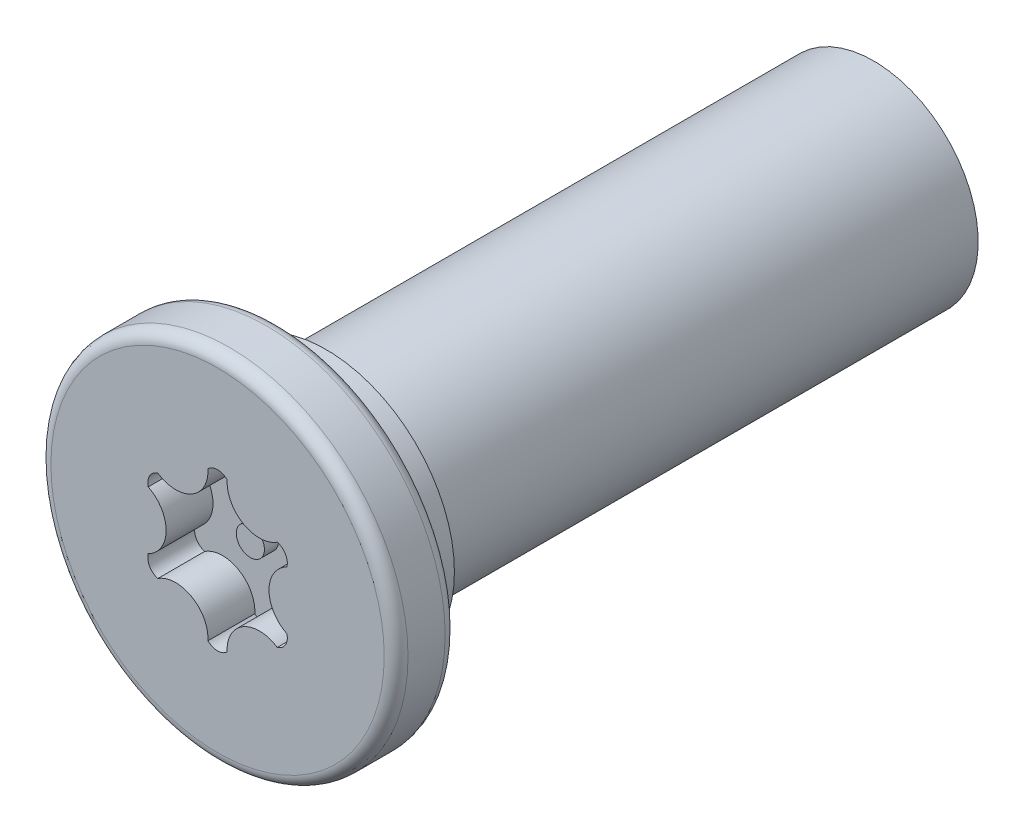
from build123d import *

# Parameters (mm, degrees)
SKETCH2_W           = 1.3
SKETCH2_H           = 3.81
SKETCH2_W_2         = 12.7
SKETCH2_H_2         = 2.23
CUT_EXTRUDE3_DEPTH  = 1
FILLET12_R          = 0.254
CUT_EXTRUDE6_START  = -12.7
SKETCH7_R           = 2.23
CUT_EXTRUDE6_DEPTH  = 12.7
SKETCH11_R          = 2.738000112
SKETCH11_R_2        = 2.230000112
BOSS_EXTRUDE1_DEPTH = 1.016
SKETCH12_R          = 2.230000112
BOSS_EXTRUDE2_DEPTH = 12.7
SKETCH14_R          = 0.3
BOSS_EXTRUDE4_DEPTH = 0.3
CUT_EXTRUDE7_START  = -12.7
SKETCH15_R          = 2.230000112
CUT_EXTRUDE7_DEPTH  = 12.7
SKETCH16_R          = 2.230000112
BOSS_EXTRUDE5_DEPTH = 12.7


with BuildPart() as part:
    # Sketch2 → Revolve1 (revolve)
    with BuildSketch(Plane(origin=(0, 0, 0), x_dir=(0, 0, -1), z_dir=(1, 0, 0)), mode=Mode.PRIVATE) as revolve1_sk:
        with Locations((0.65, 1.905)):
            Rectangle(SKETCH2_W, SKETCH2_H)
        with Locations((7.65, 1.115)):
            Rectangle(SKETCH2_W_2, SKETCH2_H_2)
    revolve(revolve1_sk.sketch.rotate(Axis((0, 0, -1.3), (0, 0, -1)), 90), axis=Axis((0, 0, -1.3), (0, 0, -1)))

    # Sketch3 → Cut-Extrude3 (cut)
    with BuildSketch(Plane.XY):
        with BuildLine():
            ThreePointArc((-0.205060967, 1.589373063), (0, 1.674312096), (0.205060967, 1.589373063))
            ThreePointArc((0.205060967, 1.589373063), (0.54882888, 0.950599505), (1.273906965, 0.972274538))
            ThreePointArc((1.273906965, 0.972274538), (1.449996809, 0.837156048), (1.478967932, 0.617098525))
            ThreePointArc((1.478967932, 0.617098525), (1.097657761, 0), (1.478967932, -0.617098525))
            ThreePointArc((1.478967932, -0.617098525), (1.449996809, -0.837156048), (1.273906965, -0.972274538))
            ThreePointArc((1.273906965, -0.972274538), (0.54882888, -0.950599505), (0.205060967, -1.589373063))
            ThreePointArc((0.205060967, -1.589373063), (0, -1.674312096), (-0.205060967, -1.589373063))
            ThreePointArc((-0.205060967, -1.589373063), (-0.54882888, -0.950599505), (-1.273906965, -0.972274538))
            ThreePointArc((-1.273906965, -0.972274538), (-1.449996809, -0.837156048), (-1.478967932, -0.617098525))
            ThreePointArc((-1.478967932, -0.617098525), (-1.097657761, 0), (-1.478967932, 0.617098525))
            ThreePointArc((-1.478967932, 0.617098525), (-1.449996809, 0.837156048), (-1.273906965, 0.972274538))
            ThreePointArc((-1.273906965, 0.972274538), (-0.54882888, 0.950599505), (-0.205060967, 1.589373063))
        make_face()
    extrude(amount=-CUT_EXTRUDE3_DEPTH, mode=Mode.SUBTRACT)

    # Fillet12
    fillet12_edges = [part.edges().sort_by_distance(p)[0] for p in [
        (-3.81, 0, 0),
        (-3.81, 0, -1.3),
    ]]
    fillet(fillet12_edges, radius=FILLET12_R)

    # Sketch7 → Cut-Extrude6 (cut)
    with BuildSketch(Plane(origin=(0, 0, -14), x_dir=(-1, 0, 0), z_dir=(0, 0, -1)).offset(CUT_EXTRUDE6_START)):
        Circle(SKETCH7_R)
    extrude(amount=CUT_EXTRUDE6_DEPTH, mode=Mode.SUBTRACT)

    # Sketch11 → Boss-Extrude1 (add)
    with BuildSketch(Plane(origin=(0, 0, -1.3), x_dir=(-1, 0, 0), z_dir=(0, 0, -1))):
        with Locations(Location((0, 0, 0), (0, 0, 180))):
            Circle(SKETCH11_R)
        Circle(SKETCH11_R_2, mode=Mode.SUBTRACT)
    extrude(amount=BOSS_EXTRUDE1_DEPTH)

    # Sketch12 → Boss-Extrude2 (add)
    with BuildSketch(Plane(origin=(0, 0, -1.3), x_dir=(-1, 0, 0), z_dir=(0, 0, -1))):
        Circle(SKETCH12_R)
    extrude(amount=BOSS_EXTRUDE2_DEPTH)

    # Sketch14 → Boss-Extrude4 (add)
    with BuildSketch(Plane.XY.offset(-1)):
        Circle(SKETCH14_R)
    extrude(amount=BOSS_EXTRUDE4_DEPTH)

    # Sketch15 → Cut-Extrude7 (cut)
    with BuildSketch(Plane(origin=(0, 0, -14), x_dir=(-1, 0, 0), z_dir=(0, 0, -1)).offset(CUT_EXTRUDE7_START)):
        Circle(SKETCH15_R)
    extrude(amount=CUT_EXTRUDE7_DEPTH, mode=Mode.SUBTRACT)

    # Sketch16 → Boss-Extrude5 (add)
    with BuildSketch(Plane(origin=(0, 0, -1.3), x_dir=(-1, 0, 0), z_dir=(0, 0, -1))):
        Circle(SKETCH16_R)
    extrude(amount=BOSS_EXTRUDE5_DEPTH)


solid = part.part
